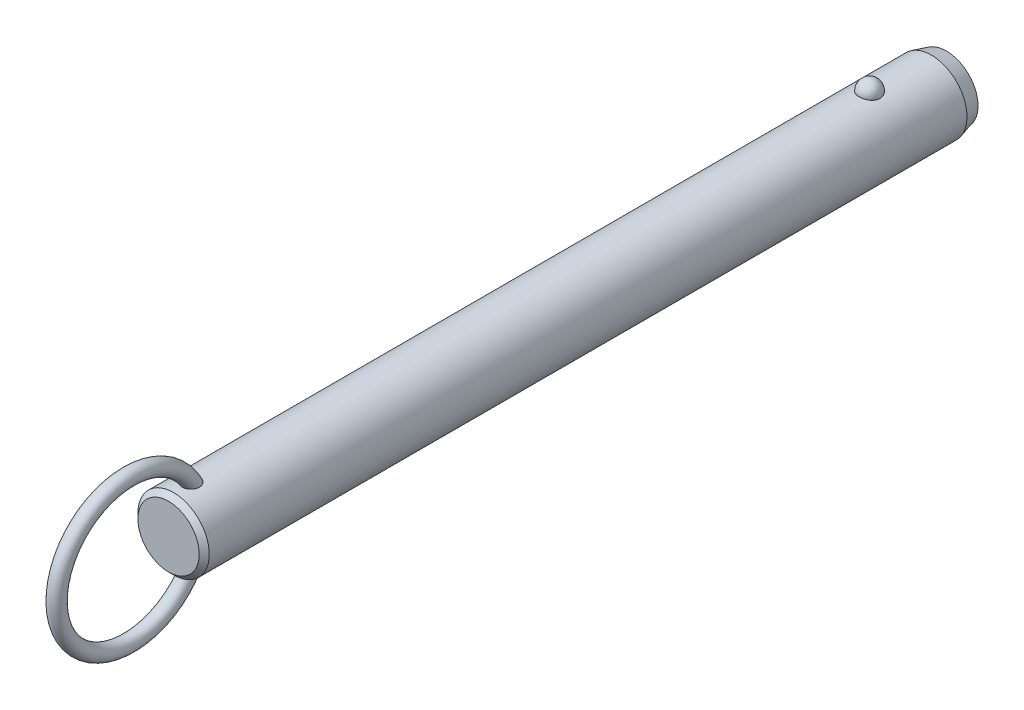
ISO-10303-21;
HEADER;
FILE_DESCRIPTION(('STEP AP214'),'2;1');
FILE_NAME('part.step','',(''),(''),'','','');
FILE_SCHEMA(('AUTOMOTIVE_DESIGN { 1 0 10303 214 1 1 1 1 }'));
ENDSEC;
DATA;
#1=APPLICATION_CONTEXT('core data for automotive mechanical design processes');
#2=APPLICATION_PROTOCOL_DEFINITION('international standard','automotive_design',2000,#1);
#3=PRODUCT_CONTEXT('',#1,'mechanical');
#4=PRODUCT('Part','Part','',(#3));
#5=PRODUCT_RELATED_PRODUCT_CATEGORY('part','',(#4));
#6=PRODUCT_DEFINITION_FORMATION('','',#4);
#7=PRODUCT_DEFINITION_CONTEXT('part definition',#1,'design');
#8=PRODUCT_DEFINITION('design','',#6,#7);
#9=PRODUCT_DEFINITION_SHAPE('','',#8);
#10=(LENGTH_UNIT() NAMED_UNIT(*) SI_UNIT(.MILLI.,.METRE.));
#11=(NAMED_UNIT(*) PLANE_ANGLE_UNIT() SI_UNIT($,.RADIAN.));
#12=(NAMED_UNIT(*) SI_UNIT($,.STERADIAN.) SOLID_ANGLE_UNIT());
#13=UNCERTAINTY_MEASURE_WITH_UNIT(LENGTH_MEASURE(1.E-05),#10,'distance_accuracy_value','');
#14=(GEOMETRIC_REPRESENTATION_CONTEXT(3) GLOBAL_UNCERTAINTY_ASSIGNED_CONTEXT((#13)) GLOBAL_UNIT_ASSIGNED_CONTEXT((#10,
#11,#12)) REPRESENTATION_CONTEXT('',''));
#15=CARTESIAN_POINT('',(0.,0.,0.));
#16=DIRECTION('',(0.,0.,1.));
#17=DIRECTION('',(1.,0.,0.));
#18=AXIS2_PLACEMENT_3D('',#15,#16,#17);
#19=CARTESIAN_POINT('',(0.,0.,129.5));
#20=DIRECTION('',(0.,0.,-1.));
#21=DIRECTION('',(-1.,0.,0.));
#22=AXIS2_PLACEMENT_3D('',#19,#20,#21);
#23=CYLINDRICAL_SURFACE('',#22,7.1);
#24=CARTESIAN_POINT('',(2.0769088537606,6.78943661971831,-2.1));
#25=CARTESIAN_POINT('',(2.07690739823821,6.78943796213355,-1.98268154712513));
#26=CARTESIAN_POINT('',(2.06738130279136,6.79237331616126,-1.86534506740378));
#27=CARTESIAN_POINT('',(2.0295040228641,6.8037853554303,-1.63400788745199));
#28=CARTESIAN_POINT('',(2.00114757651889,6.81226358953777,-1.52000812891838));
#29=CARTESIAN_POINT('',(1.92632025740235,6.83379798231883,-1.29863433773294));
#30=CARTESIAN_POINT('',(1.87985726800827,6.84685214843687,-1.19125744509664));
#31=CARTESIAN_POINT('',(1.76995205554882,6.87608091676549,-0.98604657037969));
#32=CARTESIAN_POINT('',(1.70650980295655,6.8922555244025,-0.88821260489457));
#33=CARTESIAN_POINT('',(1.5638119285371,6.92602930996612,-0.704242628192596));
#34=CARTESIAN_POINT('',(1.4844714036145,6.94363582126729,-0.618173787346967));
#35=CARTESIAN_POINT('',(1.31221746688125,6.97823658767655,-0.460740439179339));
#36=CARTESIAN_POINT('',(1.21930409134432,6.99523084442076,-0.389375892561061));
#37=CARTESIAN_POINT('',(1.02268781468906,7.02666176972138,-0.263547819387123));
#38=CARTESIAN_POINT('',(0.91902009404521,7.04110638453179,-0.209031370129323));
#39=CARTESIAN_POINT('',(0.703548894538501,7.06588726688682,-0.118163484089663));
#40=CARTESIAN_POINT('',(0.591746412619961,7.07622403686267,-0.0818098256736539));
#41=CARTESIAN_POINT('',(0.365557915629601,7.09147068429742,-0.0288711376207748));
#42=CARTESIAN_POINT('',(0.251267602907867,7.09648447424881,-0.0119070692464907));
#43=CARTESIAN_POINT('',(0.0213499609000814,7.10089837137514,0.00304925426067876));
#44=CARTESIAN_POINT('',(-0.0942772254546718,7.10029907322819,0.00104351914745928));
#45=CARTESIAN_POINT('',(-0.321651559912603,7.09360829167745,-0.0216931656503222));
#46=CARTESIAN_POINT('',(-0.433431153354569,7.08760388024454,-0.0421272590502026));
#47=CARTESIAN_POINT('',(-0.651862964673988,7.07086131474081,-0.100729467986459));
#48=CARTESIAN_POINT('',(-0.758515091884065,7.06012307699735,-0.138897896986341));
#49=CARTESIAN_POINT('',(-0.964449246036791,7.03496097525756,-0.232213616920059));
#50=CARTESIAN_POINT('',(-1.06368095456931,7.02051445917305,-0.287465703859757));
#51=CARTESIAN_POINT('',(-1.25145353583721,6.98948740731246,-0.413383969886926));
#52=CARTESIAN_POINT('',(-1.33999321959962,6.97290663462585,-0.48405186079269));
#53=CARTESIAN_POINT('',(-1.50591604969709,6.93898770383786,-0.640594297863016));
#54=CARTESIAN_POINT('',(-1.58302488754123,6.92164094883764,-0.726757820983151));
#55=CARTESIAN_POINT('',(-1.72189320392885,6.8884103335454,-0.91092752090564));
#56=CARTESIAN_POINT('',(-1.78365144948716,6.87252659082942,-1.008934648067));
#57=CARTESIAN_POINT('',(-1.89101272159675,6.84377189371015,-1.21549497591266));
#58=CARTESIAN_POINT('',(-1.93639553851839,6.83094274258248,-1.32416860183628));
#59=CARTESIAN_POINT('',(-2.00874275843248,6.81002070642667,-1.54791500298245));
#60=CARTESIAN_POINT('',(-2.03570774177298,6.80192767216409,-1.66298757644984));
#61=CARTESIAN_POINT('',(-2.07047276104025,6.7914266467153,-1.89571453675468));
#62=CARTESIAN_POINT('',(-2.07835878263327,6.78899315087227,-2.01335491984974));
#63=CARTESIAN_POINT('',(-2.07502083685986,6.79001409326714,-2.24833570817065));
#64=CARTESIAN_POINT('',(-2.06379746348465,6.7934683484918,-2.36567612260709));
#65=CARTESIAN_POINT('',(-2.02263913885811,6.80583442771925,-2.59603194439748));
#66=CARTESIAN_POINT('',(-1.99281127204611,6.81471501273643,-2.70906820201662));
#67=CARTESIAN_POINT('',(-1.91526639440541,6.83691232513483,-2.92836575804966));
#68=CARTESIAN_POINT('',(-1.8675486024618,6.85022924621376,-3.03462676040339));
#69=CARTESIAN_POINT('',(-1.75504492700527,6.87991336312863,-3.23806487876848));
#70=CARTESIAN_POINT('',(-1.69015924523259,6.89629822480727,-3.33518422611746));
#71=CARTESIAN_POINT('',(-1.54505404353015,6.93024852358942,-3.51697105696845));
#72=CARTESIAN_POINT('',(-1.46483385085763,6.94781401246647,-3.60163799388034));
#73=CARTESIAN_POINT('',(-1.29071406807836,6.98225977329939,-3.75654119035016));
#74=CARTESIAN_POINT('',(-1.19675650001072,6.99913673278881,-3.82671308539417));
#75=CARTESIAN_POINT('',(-0.997940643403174,7.03023618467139,-3.9501837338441));
#76=CARTESIAN_POINT('',(-0.89308318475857,7.04445887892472,-4.00348377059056));
#77=CARTESIAN_POINT('',(-0.676902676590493,7.06848365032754,-4.09107242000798));
#78=CARTESIAN_POINT('',(-0.565686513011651,7.0783430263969,-4.12560889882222));
#79=CARTESIAN_POINT('',(-0.338739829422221,7.09282534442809,-4.17575450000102));
#80=CARTESIAN_POINT('',(-0.223009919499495,7.09744899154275,-4.19136617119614));
#81=CARTESIAN_POINT('',(0.00707628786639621,7.10090930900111,-4.20307965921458));
#82=CARTESIAN_POINT('',(0.121410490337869,7.09986531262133,-4.19958377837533));
#83=CARTESIAN_POINT('',(0.347815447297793,7.092380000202,-4.17411564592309));
#84=CARTESIAN_POINT('',(0.459886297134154,7.08593891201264,-4.15214417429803));
#85=CARTESIAN_POINT('',(0.678084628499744,7.06838983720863,-4.09049562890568));
#86=CARTESIAN_POINT('',(0.784237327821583,7.05730369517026,-4.05090137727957));
#87=CARTESIAN_POINT('',(0.988305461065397,7.03163139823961,-3.95511447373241));
#88=CARTESIAN_POINT('',(1.08622031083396,7.01704499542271,-3.89892064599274));
#89=CARTESIAN_POINT('',(1.27284490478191,6.98562668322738,-3.77035541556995));
#90=CARTESIAN_POINT('',(1.36137372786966,6.96876135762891,-3.69772964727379));
#91=CARTESIAN_POINT('',(1.52509486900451,6.93477412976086,-3.53878279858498));
#92=CARTESIAN_POINT('',(1.60028496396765,6.91765218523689,-3.45245943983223));
#93=CARTESIAN_POINT('',(1.73681688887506,6.88465753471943,-3.26658774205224));
#94=CARTESIAN_POINT('',(1.79785966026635,6.86881574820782,-3.16681408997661));
#95=CARTESIAN_POINT('',(1.90265327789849,6.84053157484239,-2.95814408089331));
#96=CARTESIAN_POINT('',(1.94640861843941,6.82808830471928,-2.84925010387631));
#97=CARTESIAN_POINT('',(2.01274378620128,6.80881460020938,-2.63454318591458));
#98=CARTESIAN_POINT('',(2.03676193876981,6.80160856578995,-2.52920574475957));
#99=CARTESIAN_POINT('',(2.06884490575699,6.79191902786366,-2.3159172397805));
#100=CARTESIAN_POINT('',(2.07691019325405,6.78943538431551,-2.20796625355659));
#101=CARTESIAN_POINT('',(2.0769088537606,6.78943661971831,-2.1));
#102=B_SPLINE_CURVE_WITH_KNOTS('',3,(#24,#25,#26,#27,#28,#29,#30,#31,#32,#33,#34,#35,#36,#37,
#38,#39,#40,#41,#42,#43,#44,#45,#46,#47,#48,#49,#50,#51,#52,#53,#54,#55,#56,#57,#58,#59,#60,#61,
#62,#63,#64,#65,#66,#67,#68,#69,#70,#71,#72,#73,#74,#75,#76,#77,#78,#79,#80,#81,#82,#83,#84,#85,
#86,#87,#88,#89,#90,#91,#92,#93,#94,#95,#96,#97,#98,#99,#100,#101),.UNSPECIFIED.,.T.,.F.,(4,2,2,
2,2,2,2,2,2,2,2,2,2,2,2,2,2,2,2,2,2,2,2,2,2,2,2,2,2,2,2,2,2,2,2,2,2,2,4),(0.,0.351568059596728,
0.703234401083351,1.05474780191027,1.40626181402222,1.75970563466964,2.11314851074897,
2.4654696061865,2.81774759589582,3.16301449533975,3.50824481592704,3.84801136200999,
4.18778391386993,4.52968352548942,4.87162112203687,5.22076181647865,5.56993054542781,
5.92363364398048,6.27732559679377,6.62942052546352,6.98150450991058,7.33158042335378,
7.68167162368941,8.03384443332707,8.38603269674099,8.73975272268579,9.09344583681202,
9.44234545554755,9.79119807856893,10.1327344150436,10.4742563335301,10.8141898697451,
11.1541474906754,11.4997793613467,11.8454687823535,12.1979079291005,12.5502553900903,
12.8738073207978,13.1973496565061),.UNSPECIFIED.);
#103=CARTESIAN_POINT('',(2.0769088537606,6.78943661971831,-2.1));
#104=VERTEX_POINT('',#103);
#105=EDGE_CURVE('E41',#104,#104,#102,.T.);
#106=ORIENTED_EDGE('',*,*,#105,.T.);
#107=EDGE_LOOP('',(#106));
#108=FACE_BOUND('',#107,.T.);
#109=CARTESIAN_POINT('',(0.,0.,136.42));
#110=DIRECTION('',(0.,0.,1.));
#111=DIRECTION('',(1.,0.,0.));
#112=AXIS2_PLACEMENT_3D('',#109,#110,#111);
#113=CIRCLE('',#112,7.1);
#114=CARTESIAN_POINT('',(7.1,0.,136.42));
#115=VERTEX_POINT('',#114);
#116=EDGE_CURVE('E10',#115,#115,#113,.F.);
#117=ORIENTED_EDGE('',*,*,#116,.T.);
#118=EDGE_LOOP('',(#117));
#119=FACE_BOUND('',#118,.T.);
#120=CARTESIAN_POINT('',(-0.429539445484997,-7.08699541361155,131.242921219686));
#121=CARTESIAN_POINT('',(-0.508331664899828,-7.08221999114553,131.266876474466));
#122=CARTESIAN_POINT('',(-0.585039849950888,-7.07624016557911,131.297457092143));
#123=CARTESIAN_POINT('',(-0.73208265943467,-7.06254296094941,131.371024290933));
#124=CARTESIAN_POINT('',(-0.802417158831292,-7.05482554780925,131.414011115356));
#125=CARTESIAN_POINT('',(-0.934722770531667,-7.03851844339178,131.511113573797));
#126=CARTESIAN_POINT('',(-0.996700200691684,-7.02992941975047,131.565220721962));
#127=CARTESIAN_POINT('',(-1.11079942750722,-7.01280697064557,131.682967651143));
#128=CARTESIAN_POINT('',(-1.16292136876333,-7.00427354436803,131.746607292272));
#129=CARTESIAN_POINT('',(-1.25705660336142,-6.98799959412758,131.882687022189));
#130=CARTESIAN_POINT('',(-1.29888032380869,-6.98027525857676,131.955259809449));
#131=CARTESIAN_POINT('',(-1.37069920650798,-6.96652886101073,132.106168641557));
#132=CARTESIAN_POINT('',(-1.40069157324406,-6.96050720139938,132.184506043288));
#133=CARTESIAN_POINT('',(-1.45043507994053,-6.95031881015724,132.350190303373));
#134=CARTESIAN_POINT('',(-1.46937115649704,-6.94630231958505,132.437789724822));
#135=CARTESIAN_POINT('',(-1.49424917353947,-6.94099239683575,132.614871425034));
#136=CARTESIAN_POINT('',(-1.50018601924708,-6.93970003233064,132.704354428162));
#137=CARTESIAN_POINT('',(-1.49978214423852,-6.93978815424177,132.894060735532));
#138=CARTESIAN_POINT('',(-1.49187639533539,-6.94150934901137,132.994279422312));
#139=CARTESIAN_POINT('',(-1.46177925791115,-6.94790814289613,133.192479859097));
#140=CARTESIAN_POINT('',(-1.43957541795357,-6.95258831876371,133.290459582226));
#141=CARTESIAN_POINT('',(-1.37783293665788,-6.96510647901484,133.49536292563));
#142=CARTESIAN_POINT('',(-1.33634073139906,-6.97328848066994,133.601680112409));
#143=CARTESIAN_POINT('',(-1.23686994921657,-6.99161706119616,133.806177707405));
#144=CARTESIAN_POINT('',(-1.17889192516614,-7.00176357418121,133.904358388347));
#145=CARTESIAN_POINT('',(-1.05875124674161,-7.02082898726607,134.072374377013));
#146=CARTESIAN_POINT('',(-0.999247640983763,-7.02963746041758,134.144123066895));
#147=CARTESIAN_POINT('',(-0.869494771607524,-7.04686074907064,134.277195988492));
#148=CARTESIAN_POINT('',(-0.799263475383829,-7.05527619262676,134.338537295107));
#149=CARTESIAN_POINT('',(-0.665408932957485,-7.06899457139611,134.435131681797));
#150=CARTESIAN_POINT('',(-0.603817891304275,-7.07457275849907,134.473151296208));
#151=CARTESIAN_POINT('',(-0.475172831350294,-7.08437420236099,134.538758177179));
#152=CARTESIAN_POINT('',(-0.4081230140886,-7.08859848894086,134.566353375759));
#153=CARTESIAN_POINT('',(-0.26943193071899,-7.09522749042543,134.609256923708));
#154=CARTESIAN_POINT('',(-0.197757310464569,-7.09761688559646,134.624461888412));
#155=CARTESIAN_POINT('',(-0.05278498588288,-7.10017268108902,134.640716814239));
#156=CARTESIAN_POINT('',(0.020511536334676,-7.10034065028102,134.641776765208));
#157=CARTESIAN_POINT('',(0.156426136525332,-7.09855986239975,134.630461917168));
#158=CARTESIAN_POINT('',(0.219199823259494,-7.09688191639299,134.619806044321));
#159=CARTESIAN_POINT('',(0.342134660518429,-7.09201880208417,134.588537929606));
#160=CARTESIAN_POINT('',(0.402295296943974,-7.08883333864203,134.567923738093));
#161=CARTESIAN_POINT('',(0.520687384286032,-7.08113868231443,134.517212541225));
#162=CARTESIAN_POINT('',(0.578791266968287,-7.07658958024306,134.486827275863));
#163=CARTESIAN_POINT('',(0.69017323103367,-7.06659708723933,134.418367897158));
#164=CARTESIAN_POINT('',(0.743447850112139,-7.061153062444,134.380288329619));
#165=CARTESIAN_POINT('',(0.87094790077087,-7.04680292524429,134.276592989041));
#166=CARTESIAN_POINT('',(0.941828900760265,-7.03755800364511,134.206897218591));
#167=CARTESIAN_POINT('',(1.07136606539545,-7.01900793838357,134.056945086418));
#168=CARTESIAN_POINT('',(1.13000013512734,-7.00970271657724,133.976670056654));
#169=CARTESIAN_POINT('',(1.23579584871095,-6.99183327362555,133.806899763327));
#170=CARTESIAN_POINT('',(1.28274271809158,-6.98328455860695,133.717269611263));
#171=CARTESIAN_POINT('',(1.3635144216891,-6.96796352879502,133.532176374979));
#172=CARTESIAN_POINT('',(1.39733971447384,-6.96119115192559,133.436713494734));
#173=CARTESIAN_POINT('',(1.45579181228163,-6.94922464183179,133.22530928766));
#174=CARTESIAN_POINT('',(1.47790145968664,-6.94449000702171,133.108631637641));
#175=CARTESIAN_POINT('',(1.50168752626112,-6.93938731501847,132.873015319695));
#176=CARTESIAN_POINT('',(1.50336085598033,-6.93901991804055,132.75407631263));
#177=CARTESIAN_POINT('',(1.48486516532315,-6.9430010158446,132.52360799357));
#178=CARTESIAN_POINT('',(1.46573441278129,-6.9471253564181,132.411995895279));
#179=CARTESIAN_POINT('',(1.40606892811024,-6.95944667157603,132.194886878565));
#180=CARTESIAN_POINT('',(1.36556446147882,-6.96763788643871,132.0893815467));
#181=CARTESIAN_POINT('',(1.2708270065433,-6.98548038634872,131.904287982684));
#182=CARTESIAN_POINT('',(1.21949810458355,-6.99473841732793,131.823171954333));
#183=CARTESIAN_POINT('',(1.10242050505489,-7.0141406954,131.672227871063));
#184=CARTESIAN_POINT('',(1.03668119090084,-7.02428436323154,131.60239252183));
#185=CARTESIAN_POINT('',(0.900559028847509,-7.04295285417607,131.483573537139));
#186=CARTESIAN_POINT('',(0.831428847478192,-7.05153466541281,131.433157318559));
#187=CARTESIAN_POINT('',(0.685291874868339,-7.06723150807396,131.345142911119));
#188=CARTESIAN_POINT('',(0.608287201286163,-7.07434693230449,131.307541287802));
#189=CARTESIAN_POINT('',(0.451878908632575,-7.08602232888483,131.247491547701));
#190=CARTESIAN_POINT('',(0.372686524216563,-7.09067127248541,131.224508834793));
#191=CARTESIAN_POINT('',(0.211477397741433,-7.09730788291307,131.192035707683));
#192=CARTESIAN_POINT('',(0.12946098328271,-7.09929585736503,131.18254373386));
#193=CARTESIAN_POINT('',(-0.0332905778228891,-7.10037858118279,131.177351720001));
#194=CARTESIAN_POINT('',(-0.114016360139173,-7.09953334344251,131.181365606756));
#195=CARTESIAN_POINT('',(-0.27367033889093,-7.09517338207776,131.202454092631));
#196=CARTESIAN_POINT('',(-0.352598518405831,-7.09165863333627,131.219528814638));
#197=CARTESIAN_POINT('',(-0.429539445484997,-7.08699541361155,131.242921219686));
#198=B_SPLINE_CURVE_WITH_KNOTS('',3,(#120,#121,#122,#123,#124,#125,#126,#127,#128,#129,#130,
#131,#132,#133,#134,#135,#136,#137,#138,#139,#140,#141,#142,#143,#144,#145,#146,#147,#148,#149,
#150,#151,#152,#153,#154,#155,#156,#157,#158,#159,#160,#161,#162,#163,#164,#165,#166,#167,#168,
#169,#170,#171,#172,#173,#174,#175,#176,#177,#178,#179,#180,#181,#182,#183,#184,#185,#186,#187,
#188,#189,#190,#191,#192,#193,#194,#195,#196,#197),.UNSPECIFIED.,.T.,.F.,(4,2,2,2,2,2,2,2,2,2,2,
2,2,2,2,2,2,2,2,2,2,2,2,2,2,2,2,2,2,2,2,2,2,2,2,2,2,2,4),(0.,0.247183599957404,
0.494372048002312,0.741372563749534,0.988369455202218,1.23962059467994,1.490931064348,
1.75897818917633,2.02713035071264,2.3275826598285,2.62829697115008,2.97008736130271,
3.31186629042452,3.59175319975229,3.87117637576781,4.08813841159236,4.30493502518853,
4.5235225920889,4.74195577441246,4.93215328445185,5.12238804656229,5.318848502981,
5.51544871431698,5.81332317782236,6.11173048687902,6.41527266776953,6.71880423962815,
7.07358156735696,7.42841252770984,7.76631485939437,8.10373999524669,8.39142246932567,
8.67891817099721,8.93560332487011,9.19221962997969,9.43881106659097,9.68537399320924,
9.92674752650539,10.1681233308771),.UNSPECIFIED.);
#199=CARTESIAN_POINT('',(-0.429539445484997,-7.08699541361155,131.242921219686));
#200=VERTEX_POINT('',#199);
#201=EDGE_CURVE('E60',#200,#200,#198,.T.);
#202=ORIENTED_EDGE('',*,*,#201,.T.);
#203=EDGE_LOOP('',(#202));
#204=FACE_BOUND('',#203,.T.);
#205=CARTESIAN_POINT('',(-0.429539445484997,7.08699541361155,131.242921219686));
#206=CARTESIAN_POINT('',(-0.351665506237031,7.09171429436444,131.219246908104));
#207=CARTESIAN_POINT('',(-0.271733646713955,7.09525896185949,131.202036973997));
#208=CARTESIAN_POINT('',(-0.110026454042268,7.09960839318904,131.181005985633));
#209=CARTESIAN_POINT('',(-0.0282502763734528,7.10041187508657,131.177191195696));
#210=CARTESIAN_POINT('',(0.134782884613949,7.09918849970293,131.183059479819));
#211=CARTESIAN_POINT('',(0.216039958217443,7.09716214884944,131.19274013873));
#212=CARTESIAN_POINT('',(0.375730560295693,7.09050177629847,131.225347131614));
#213=CARTESIAN_POINT('',(0.454164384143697,7.08586802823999,131.248272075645));
#214=CARTESIAN_POINT('',(0.606025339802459,7.07449911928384,131.306771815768));
#215=CARTESIAN_POINT('',(0.679451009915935,7.06776334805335,131.342350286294));
#216=CARTESIAN_POINT('',(0.81923414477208,7.05292866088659,131.425175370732));
#217=CARTESIAN_POINT('',(0.885591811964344,7.04482978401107,131.472421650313));
#218=CARTESIAN_POINT('',(1.00993211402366,7.02808709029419,131.577590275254));
#219=CARTESIAN_POINT('',(1.06785399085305,7.01943990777,131.635583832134));
#220=CARTESIAN_POINT('',(1.17342527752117,7.00256662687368,131.760301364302));
#221=CARTESIAN_POINT('',(1.22107408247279,6.99434055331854,131.827025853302));
#222=CARTESIAN_POINT('',(1.30652927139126,6.97889183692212,131.969362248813));
#223=CARTESIAN_POINT('',(1.34399711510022,6.97170674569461,132.045180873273));
#224=CARTESIAN_POINT('',(1.40682616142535,6.95930080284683,132.201810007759));
#225=CARTESIAN_POINT('',(1.43218374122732,6.95408053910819,132.28262200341));
#226=CARTESIAN_POINT('',(1.47246409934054,6.94566853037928,132.453531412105));
#227=CARTESIAN_POINT('',(1.48642590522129,6.9426653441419,132.54386307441));
#228=CARTESIAN_POINT('',(1.5011410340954,6.93949744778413,132.725619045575));
#229=CARTESIAN_POINT('',(1.50188917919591,6.93933385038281,132.817043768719));
#230=CARTESIAN_POINT('',(1.49030464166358,6.94183245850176,133.01084381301));
#231=CARTESIAN_POINT('',(1.47627413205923,6.94486147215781,133.113112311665));
#232=CARTESIAN_POINT('',(1.43356351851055,6.95380194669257,133.314471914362));
#233=CARTESIAN_POINT('',(1.4048676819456,6.95971650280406,133.413559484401));
#234=CARTESIAN_POINT('',(1.32908750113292,6.97461208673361,133.618908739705));
#235=CARTESIAN_POINT('',(1.28011435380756,6.98388945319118,133.724456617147));
#236=CARTESIAN_POINT('',(1.16520357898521,7.00397743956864,133.925760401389));
#237=CARTESIAN_POINT('',(1.09927694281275,7.01478706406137,134.021522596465));
#238=CARTESIAN_POINT('',(0.969361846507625,7.03373936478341,134.176756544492));
#239=CARTESIAN_POINT('',(0.909042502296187,7.04187023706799,134.239303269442));
#240=CARTESIAN_POINT('',(0.779178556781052,7.05741732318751,134.354053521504));
#241=CARTESIAN_POINT('',(0.709649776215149,7.06483472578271,134.406274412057));
#242=CARTESIAN_POINT('',(0.576854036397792,7.0767751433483,134.488113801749));
#243=CARTESIAN_POINT('',(0.515118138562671,7.08158033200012,134.520164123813));
#244=CARTESIAN_POINT('',(0.387127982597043,7.08972701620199,134.573765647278));
#245=CARTESIAN_POINT('',(0.320877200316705,7.09306962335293,134.595324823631));
#246=CARTESIAN_POINT('',(0.185041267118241,7.09791507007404,134.626400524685));
#247=CARTESIAN_POINT('',(0.115437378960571,7.09940591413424,134.635838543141));
#248=CARTESIAN_POINT('',(-0.024315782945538,7.10030171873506,134.641522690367));
#249=CARTESIAN_POINT('',(-0.0944648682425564,7.0997073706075,134.637773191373));
#250=CARTESIAN_POINT('',(-0.225713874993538,7.09668414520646,134.618508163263));
#251=CARTESIAN_POINT('',(-0.287006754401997,7.09444865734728,134.604232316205));
#252=CARTESIAN_POINT('',(-0.406555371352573,7.08860360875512,134.566368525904));
#253=CARTESIAN_POINT('',(-0.464809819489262,7.08499346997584,134.542776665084));
#254=CARTESIAN_POINT('',(-0.594955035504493,7.07541654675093,134.478923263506));
#255=CARTESIAN_POINT('',(-0.665389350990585,7.06906574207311,134.435753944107));
#256=CARTESIAN_POINT('',(-0.798242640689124,7.05530261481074,134.338587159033));
#257=CARTESIAN_POINT('',(-0.860645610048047,7.0478882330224,134.284568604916));
#258=CARTESIAN_POINT('',(-0.994249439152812,7.03045217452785,134.150996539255));
#259=CARTESIAN_POINT('',(-1.06260129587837,7.02030745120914,134.068614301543));
#260=CARTESIAN_POINT('',(-1.18502045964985,7.00068382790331,133.893843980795));
#261=CARTESIAN_POINT('',(-1.23907684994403,6.99120544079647,133.801448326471));
#262=CARTESIAN_POINT('',(-1.33335589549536,6.97384343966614,133.608008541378));
#263=CARTESIAN_POINT('',(-1.37336138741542,6.96598557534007,133.506856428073));
#264=CARTESIAN_POINT('',(-1.43770677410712,6.95299053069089,133.299504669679));
#265=CARTESIAN_POINT('',(-1.46204473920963,6.94785368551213,133.19330440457));
#266=CARTESIAN_POINT('',(-1.49537533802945,6.94076296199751,132.968231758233));
#267=CARTESIAN_POINT('',(-1.50273564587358,6.93914842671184,132.84909751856));
#268=CARTESIAN_POINT('',(-1.4954555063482,6.94072368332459,132.611470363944));
#269=CARTESIAN_POINT('',(-1.48082914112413,6.94391040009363,132.492977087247));
#270=CARTESIAN_POINT('',(-1.43076401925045,6.95438579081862,132.273432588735));
#271=CARTESIAN_POINT('',(-1.39762227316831,6.96121852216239,132.171841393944));
#272=CARTESIAN_POINT('',(-1.31211274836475,6.97783941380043,131.977351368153));
#273=CARTESIAN_POINT('',(-1.25976607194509,6.98762432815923,131.88444313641));
#274=CARTESIAN_POINT('',(-1.14583073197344,7.00713153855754,131.724160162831));
#275=CARTESIAN_POINT('',(-1.08665947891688,7.01665982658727,131.655035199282));
#276=CARTESIAN_POINT('',(-0.956606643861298,7.03556646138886,131.528878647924));
#277=CARTESIAN_POINT('',(-0.885737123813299,7.04494495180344,131.471834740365));
#278=CARTESIAN_POINT('',(-0.751558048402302,7.06035735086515,131.383100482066));
#279=CARTESIAN_POINT('',(-0.690120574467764,7.0666695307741,131.348593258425));
#280=CARTESIAN_POINT('',(-0.562815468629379,7.07794609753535,131.288750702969));
#281=CARTESIAN_POINT('',(-0.496948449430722,7.08291067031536,131.263414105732));
#282=CARTESIAN_POINT('',(-0.429539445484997,7.08699541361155,131.242921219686));
#283=B_SPLINE_CURVE_WITH_KNOTS('',3,(#205,#206,#207,#208,#209,#210,#211,#212,#213,#214,#215,
#216,#217,#218,#219,#220,#221,#222,#223,#224,#225,#226,#227,#228,#229,#230,#231,#232,#233,#234,
#235,#236,#237,#238,#239,#240,#241,#242,#243,#244,#245,#246,#247,#248,#249,#250,#251,#252,#253,
#254,#255,#256,#257,#258,#259,#260,#261,#262,#263,#264,#265,#266,#267,#268,#269,#270,#271,#272,
#273,#274,#275,#276,#277,#278,#279,#280,#281,#282),.UNSPECIFIED.,.T.,.F.,(4,2,2,2,2,2,2,2,2,2,2,
2,2,2,2,2,2,2,2,2,2,2,2,2,2,2,2,2,2,2,2,2,2,2,2,2,2,2,4),(0.,0.244335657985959,
0.488785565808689,0.733191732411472,0.977572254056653,1.22202379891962,1.46646834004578,
1.71259457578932,1.9587352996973,2.21226768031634,2.46587585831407,2.73913816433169,
3.01250754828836,3.32109936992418,3.63002293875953,3.9786351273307,4.32702187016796,
4.58793945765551,4.84841449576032,5.05676704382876,5.26496096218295,5.47449661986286,
5.68396281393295,5.87205447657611,6.06022532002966,6.30743751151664,6.55513496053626,
6.87602468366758,7.19715875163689,7.5230577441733,7.84899686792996,8.20516155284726,
8.56109821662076,8.88040084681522,9.19935367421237,9.47236282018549,9.74509220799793,
9.95662250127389,10.1681235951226),.UNSPECIFIED.);
#284=CARTESIAN_POINT('',(-0.429539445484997,7.08699541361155,131.242921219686));
#285=VERTEX_POINT('',#284);
#286=EDGE_CURVE('E67',#285,#285,#283,.T.);
#287=ORIENTED_EDGE('',*,*,#286,.T.);
#288=EDGE_LOOP('',(#287));
#289=FACE_BOUND('',#288,.T.);
#290=CARTESIAN_POINT('',(0.,0.,-14.4));
#291=DIRECTION('',(0.,0.,-1.));
#292=DIRECTION('',(-1.,0.,0.));
#293=AXIS2_PLACEMENT_3D('',#290,#291,#292);
#294=CIRCLE('',#293,7.1);
#295=CARTESIAN_POINT('',(-7.1,0.,-14.4));
#296=VERTEX_POINT('',#295);
#297=EDGE_CURVE('E57',#296,#296,#294,.F.);
#298=ORIENTED_EDGE('',*,*,#297,.T.);
#299=EDGE_LOOP('',(#298));
#300=FACE_BOUND('',#299,.T.);
#301=ADVANCED_FACE('F37',(#108,#119,#204,#289,#300),#23,.T.);
#302=CARTESIAN_POINT('',(0.,0.,-17.4));
#303=DIRECTION('',(0.,0.,-1.));
#304=DIRECTION('',(-1.,0.,0.));
#305=AXIS2_PLACEMENT_3D('',#302,#303,#304);
#306=PLANE('',#305);
#307=CARTESIAN_POINT('',(0.,0.,-17.4));
#308=DIRECTION('',(0.,0.,-1.));
#309=DIRECTION('',(-1.,0.,0.));
#310=AXIS2_PLACEMENT_3D('',#307,#308,#309);
#311=CIRCLE('',#310,6.29615242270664);
#312=CARTESIAN_POINT('',(-6.29615242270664,0.,-17.4));
#313=VERTEX_POINT('',#312);
#314=EDGE_CURVE('E66',#313,#313,#311,.T.);
#315=ORIENTED_EDGE('',*,*,#314,.T.);
#316=EDGE_LOOP('',(#315));
#317=FACE_BOUND('',#316,.T.);
#318=ADVANCED_FACE('F85',(#317),#306,.T.);
#319=CARTESIAN_POINT('',(0.,0.,-17.4));
#320=DIRECTION('',(0.,0.,1.));
#321=DIRECTION('',(1.,0.,0.));
#322=AXIS2_PLACEMENT_3D('',#319,#320,#321);
#323=CONICAL_SURFACE('',#322,6.29615242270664,0.261799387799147);
#324=ORIENTED_EDGE('',*,*,#297,.F.);
#325=EDGE_LOOP('',(#324));
#326=FACE_BOUND('',#325,.T.);
#327=ORIENTED_EDGE('',*,*,#314,.F.);
#328=EDGE_LOOP('',(#327));
#329=FACE_BOUND('',#328,.T.);
#330=ADVANCED_FACE('F83',(#326,#329),#323,.T.);
#331=CARTESIAN_POINT('',(0.,0.,137.42));
#332=DIRECTION('',(0.,0.,1.));
#333=DIRECTION('',(1.,0.,0.));
#334=AXIS2_PLACEMENT_3D('',#331,#332,#333);
#335=PLANE('',#334);
#336=CARTESIAN_POINT('',(0.,0.,137.42));
#337=DIRECTION('',(0.,0.,1.));
#338=DIRECTION('',(1.,0.,0.));
#339=AXIS2_PLACEMENT_3D('',#336,#337,#338);
#340=CIRCLE('',#339,6.10000000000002);
#341=CARTESIAN_POINT('',(6.10000000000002,0.,137.42));
#342=VERTEX_POINT('',#341);
#343=EDGE_CURVE('E50',#342,#342,#340,.T.);
#344=ORIENTED_EDGE('',*,*,#343,.T.);
#345=EDGE_LOOP('',(#344));
#346=FACE_BOUND('',#345,.T.);
#347=ADVANCED_FACE('F77',(#346),#335,.T.);
#348=CARTESIAN_POINT('',(0.,0.,145.35));
#349=DIRECTION('',(1.,0.,0.));
#350=DIRECTION('',(0.,0.,-1.));
#351=AXIS2_PLACEMENT_3D('',#348,#349,#350);
#352=TOROIDAL_SURFACE('',#351,14.35,1.5);
#353=ORIENTED_EDGE('',*,*,#286,.F.);
#354=EDGE_LOOP('',(#353));
#355=FACE_BOUND('',#354,.T.);
#356=ORIENTED_EDGE('',*,*,#201,.F.);
#357=EDGE_LOOP('',(#356));
#358=FACE_BOUND('',#357,.T.);
#359=ADVANCED_FACE('F73',(#355,#358),#352,.T.);
#360=CARTESIAN_POINT('',(0.,0.,137.42));
#361=DIRECTION('',(0.,0.,-1.));
#362=DIRECTION('',(-1.,0.,0.));
#363=AXIS2_PLACEMENT_3D('',#360,#361,#362);
#364=CONICAL_SURFACE('',#363,6.10000000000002,0.785398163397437);
#365=ORIENTED_EDGE('',*,*,#116,.F.);
#366=EDGE_LOOP('',(#365));
#367=FACE_BOUND('',#366,.T.);
#368=ORIENTED_EDGE('',*,*,#343,.F.);
#369=EDGE_LOOP('',(#368));
#370=FACE_BOUND('',#369,.T.);
#371=ADVANCED_FACE('F39',(#367,#370),#364,.T.);
#372=CARTESIAN_POINT('',(0.,7.1,-2.1));
#373=DIRECTION('',(0.,1.,0.));
#374=DIRECTION('',(0.,0.,1.));
#375=AXIS2_PLACEMENT_3D('',#372,#373,#374);
#376=SPHERICAL_SURFACE('',#375,2.10000000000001);
#377=ORIENTED_EDGE('',*,*,#105,.F.);
#378=EDGE_LOOP('',(#377));
#379=FACE_BOUND('',#378,.T.);
#380=ADVANCED_FACE('F79',(#379),#376,.T.);
#381=CLOSED_SHELL('',(#301,#318,#330,#347,#359,#371,#380));
#382=MANIFOLD_SOLID_BREP('B2',#381);
#383=ADVANCED_BREP_SHAPE_REPRESENTATION('',(#18,#382),#14);
#384=SHAPE_DEFINITION_REPRESENTATION(#9,#383);
ENDSEC;
END-ISO-10303-21;
